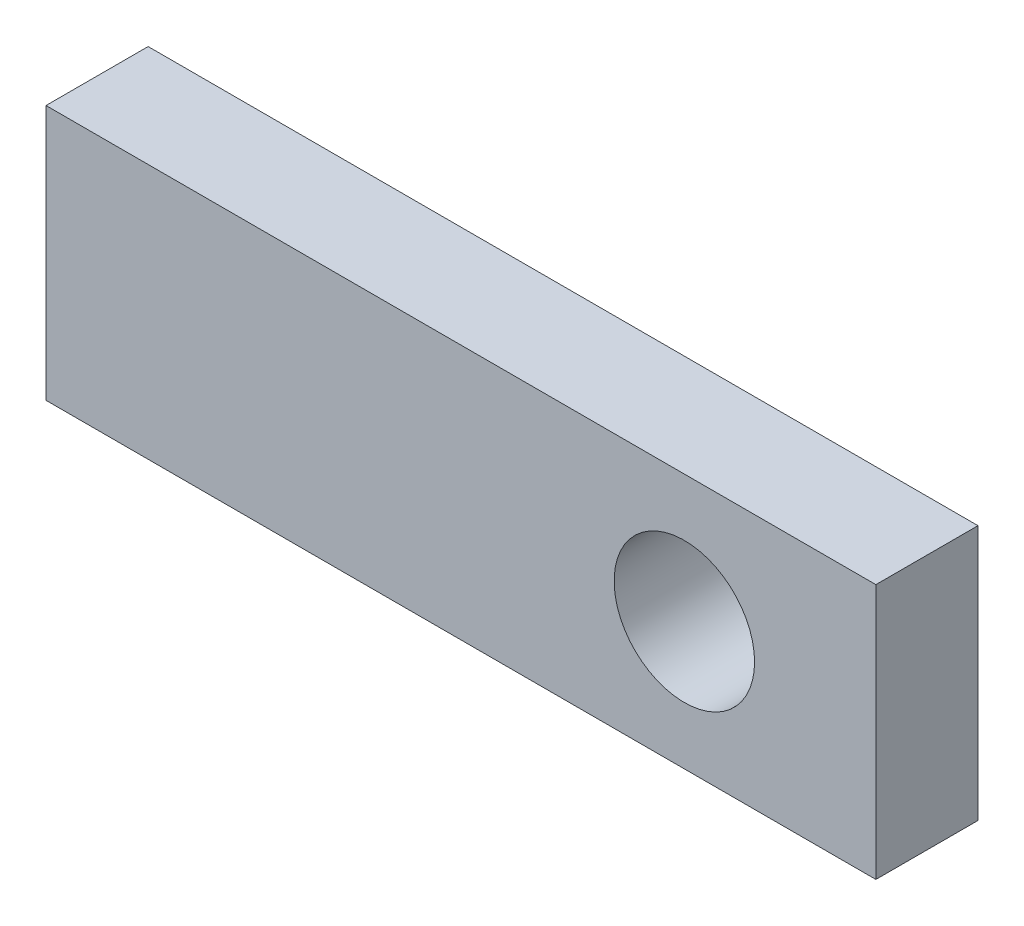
from build123d import *

# Parameters (mm, degrees)
ESQUISSE1_W             = 65
ESQUISSE1_H             = 20
EXTRUSION1_DEPTH        = 8
ESQUISSE2_R             = 5.5
ENL_V_MAT_EXTRU_1_DEPTH = 8


with BuildPart() as part:
    # Esquisse1 → Extrusion1 (new body)
    with BuildSketch(Plane.XY):
        with Locations((32.5, 10)):
            Rectangle(ESQUISSE1_W, ESQUISSE1_H)
    extrude(amount=EXTRUSION1_DEPTH)

    # Esquisse2 → Enl_v. mat.-Extru.1 (cut)
    with BuildSketch(Plane.XY.offset(8)):
        with Locations((50, 10)):
            Circle(ESQUISSE2_R)
    extrude(amount=-ENL_V_MAT_EXTRU_1_DEPTH, mode=Mode.SUBTRACT)


solid = part.part
